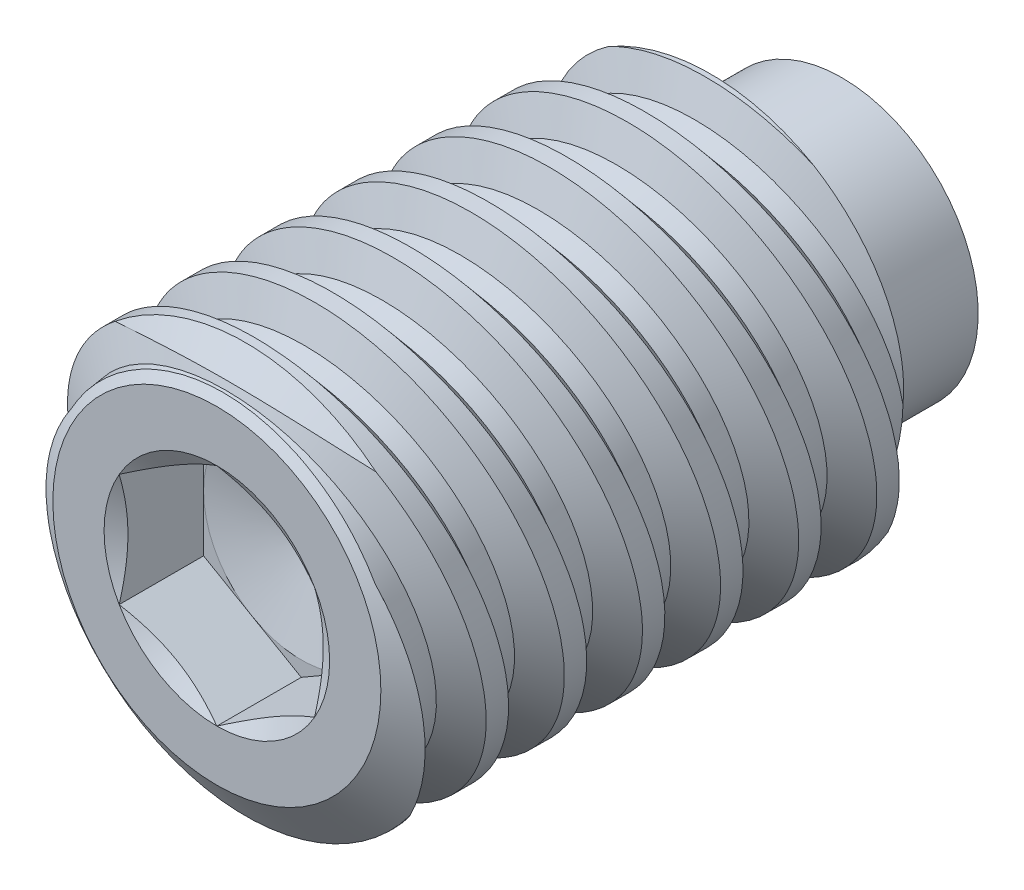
from build123d import *

# Parameters (mm, degrees)
LPATTERN1_COUNT      = 7
LPATTERN1_PITCH      = 0.79375
LPATTERN1_COUNT_DIR2 = 2
LPATTERN1_PITCH_DIR2 = 0.79375
CUT_EXTRUDE10_DEPTH  = 0.85725


with BuildPart() as part:
    # Sketch22 → Revolve1 (revolve)
    with BuildSketch(Plane(origin=(0, 0, 0), x_dir=(0, 0, -1), z_dir=(1, 0, 0))):
        Polygon((-3.175, 0), (-3.175, 1.66624), (-2.883321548, 2.0828), (1.842298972, 2.0828), (2.0828, 1.66624), (2.0828, 1.3843), (3.175, 1.3843), (3.175, 0), align=None)
    revolve(axis=Axis((0, 0, -3.683525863), (0, 0, 1)))

    # Sketch6 → Cut-Revolve8 (revolve, cut)
    with BuildSketch(Plane(origin=(0, 0, 0), x_dir=(0, 0, -1), z_dir=(1, 0, 0))):
        Polygon((1.67905471, 1.762908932), (1.484124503, 1.725765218), (1.160043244, 2.101371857), (1.842298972, 2.231374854), align=None)
    cut_revolve8 = revolve(axis=Axis((0, 0.162231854, -2.765363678), (0, -0.18718091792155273, 0.9823254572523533)), mode=Mode.SUBTRACT)

    # LPattern1: Cut-Revolve8 7 × 2
    with Locations(*[Vector(0, 0, 1) * (i * LPATTERN1_PITCH) + Vector(0, 0, 1) * (j * LPATTERN1_PITCH_DIR2) for i in range(LPATTERN1_COUNT) for j in range(LPATTERN1_COUNT_DIR2) if (i, j) != (0, 0)]):
        add(cut_revolve8, mode=Mode.SUBTRACT)

    # Sketch23 → Cut-Extrude10 (cut)
    with BuildSketch(Plane.XY.offset(3.175)):
        Polygon((0, 1.14567944), (-0.9921875, 0.57283972), (-0.9921875, -0.57283972), (0, -1.14567944), (0.9921875, -0.57283972), (0.9921875, 0.57283972), align=None)
    extrude(amount=-CUT_EXTRUDE10_DEPTH, mode=Mode.SUBTRACT)

    # Cut-Extrude11 cone 1 section (on through the dimple's axis) → Cut-Extrude11 (revolve, cut)
    with BuildSketch(Plane(origin=(0, 0, 3.175), x_dir=(0, -1, 0), z_dir=(1, 0, 0))):
        Polygon((0, 0), (1.14567944, 0), (0, 0.661458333), align=None)
    revolve(axis=Axis((0, 0, 3.175), (0, 0, -1)), mode=Mode.SUBTRACT)

    # Cut-Extrude12 cone 1 section (on through the dimple's axis) → Cut-Extrude12 (revolve, cut)
    with BuildSketch(Plane(origin=(0, 0, 2.31775), x_dir=(0, -1, 0), z_dir=(1, 0, 0))):
        Polygon((0, 0), (0.9921875, 0), (0, 0.265855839), align=None)
    revolve(axis=Axis((0, 0, 2.31775), (0, 0, -1)), mode=Mode.SUBTRACT)


solid = part.part
